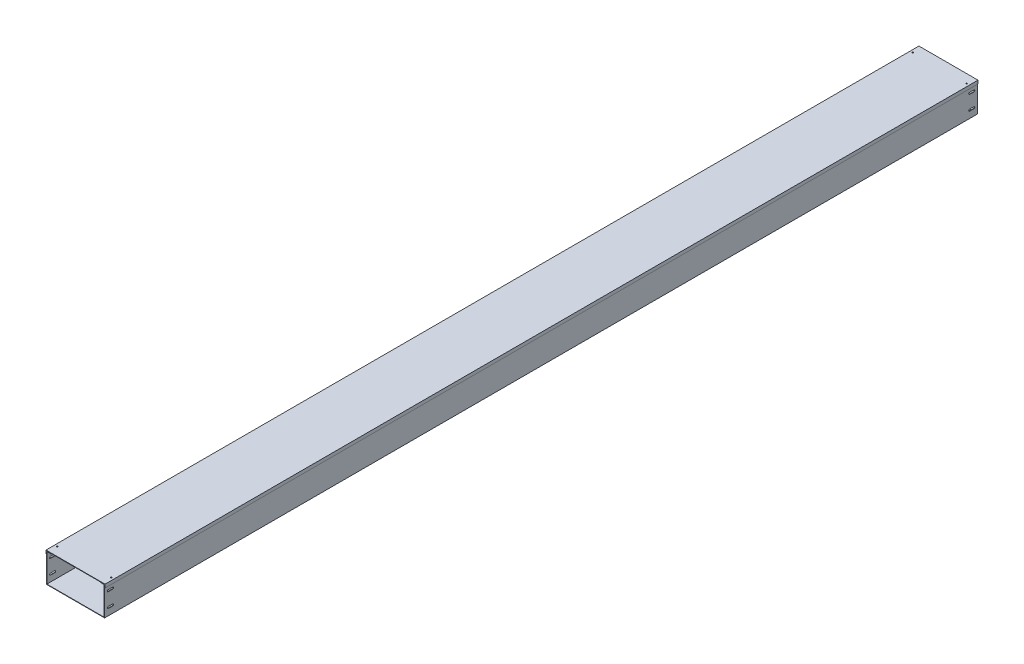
from build123d import *

# Parameters (mm, degrees)
EXTRUSION_DEPTH         = 3000
CUT_EXTRUDE1_DEPTH      = 3003.082610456
CUT_EXTRUDE1_DEPTH_BACK = 3003.082610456
CUT_EXTRUDE2_DEPTH      = 3003.082610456
CUT_EXTRUDE2_DEPTH_BACK = 3003.082610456
CUT_EXTRUDE3_REACH      = 3005.331
SKETCH3_R               = 2
CUT_EXTRUDE4_REACH      = 3005.331
SKETCH4_R               = 2
EXTRUDE_THIN1_DEPTH     = 3000
SKETCH6_R               = 2
CUT_EXTRUDE5_DEPTH      = 1.5
SKETCH7_R               = 2
CUT_EXTRUDE6_DEPTH      = 1.5


with BuildPart() as part:
    # DuctSketch → Extrusion (new body)
    with BuildSketch(Plane.XY):
        Polygon((-85, 50), (-100, 50), (-100, -50), (100, -50), (100, 50), (85, 50), (85, 48.5), (98.5, 48.5), (98.5, -48.5), (-98.5, -48.5), (-98.5, 48.5), (-85, 48.5), align=None)
    extrude(amount=EXTRUSION_DEPTH)

    # Sketch1 → Cut-Extrude1 (cut, two sides: drawn at the far end of the back side and taken through both)
    with BuildSketch(Plane(origin=(0, 0, 0), x_dir=(0, 0, -1), z_dir=(1, 0, 0)).offset(-CUT_EXTRUDE1_DEPTH_BACK)):
        with BuildLine():
            Line((-27.5, 28), (-12.5, 28))
            ThreePointArc((-12.5, 28), (-9.5, 25), (-12.5, 22))
            Line((-12.5, 22), (-27.5, 22))
            ThreePointArc((-27.5, 22), (-30.5, 25), (-27.5, 28))
        make_face()
        with BuildLine():
            Line((-27.5, -22), (-12.5, -22))
            ThreePointArc((-12.5, -22), (-9.5, -25), (-12.5, -28))
            Line((-12.5, -28), (-27.5, -28))
            ThreePointArc((-27.5, -28), (-30.5, -25), (-27.5, -22))
        make_face()
    extrude(amount=CUT_EXTRUDE1_DEPTH + CUT_EXTRUDE1_DEPTH_BACK, mode=Mode.SUBTRACT)

    # Sketch2 → Cut-Extrude2 (cut, two sides: drawn at the far end of the back side and taken through both)
    with BuildSketch(Plane(origin=(0, 0, 0), x_dir=(0, 0, -1), z_dir=(1, 0, 0)).offset(-CUT_EXTRUDE2_DEPTH_BACK)):
        with BuildLine():
            Line((-2987.5, 28), (-2972.5, 28))
            ThreePointArc((-2972.5, 28), (-2969.5, 25), (-2972.5, 22))
            Line((-2972.5, 22), (-2987.5, 22))
            ThreePointArc((-2987.5, 22), (-2990.5, 25), (-2987.5, 28))
        make_face()
        with BuildLine():
            Line((-2987.5, -22), (-2972.5, -22))
            ThreePointArc((-2972.5, -22), (-2969.5, -25), (-2972.5, -28))
            Line((-2972.5, -28), (-2987.5, -28))
            ThreePointArc((-2987.5, -28), (-2990.5, -25), (-2987.5, -22))
        make_face()
    extrude(amount=CUT_EXTRUDE2_DEPTH + CUT_EXTRUDE2_DEPTH_BACK, mode=Mode.SUBTRACT)

    # Sketch3 → Cut-Extrude3 (cut, up to next)
    with BuildSketch(Plane(origin=(0, 50, 0), x_dir=(1, 0, 0), z_dir=(0, 1, 0)), mode=Mode.PRIVATE) as cut_extrude3_sk1:
        with Locations(Location((-92.5, -30, 0), (0, 0, 270))):
            Circle(SKETCH3_R)
    cut_extrude3_tool1 = extrude(cut_extrude3_sk1.sketch, amount=-CUT_EXTRUDE3_REACH, mode=Mode.PRIVATE) & part.part
    # Sketch3 → Cut-Extrude3 (cut, up to next)
    with BuildSketch(Plane(origin=(0, 50, 0), x_dir=(1, 0, 0), z_dir=(0, 1, 0)), mode=Mode.PRIVATE) as cut_extrude3_sk2:
        with Locations(Location((92.5, -30, 0), (0, 0, 270))):
            Circle(SKETCH3_R)
    cut_extrude3_tool2 = extrude(cut_extrude3_sk2.sketch, amount=-CUT_EXTRUDE3_REACH, mode=Mode.PRIVATE) & part.part
    add(cut_extrude3_tool1.solids().sort_by_distance((-92.5, 50, 30))[0], mode=Mode.SUBTRACT)
    add(cut_extrude3_tool2.solids().sort_by_distance((92.5, 50, 30))[0], mode=Mode.SUBTRACT)

    # Sketch4 → Cut-Extrude4 (cut, up to next)
    with BuildSketch(Plane(origin=(0, 50, 0), x_dir=(1, 0, 0), z_dir=(0, 1, 0)), mode=Mode.PRIVATE) as cut_extrude4_sk1:
        with Locations(Location((-92.5, -2970, 0), (0, 0, 270))):
            Circle(SKETCH4_R)
    cut_extrude4_tool1 = extrude(cut_extrude4_sk1.sketch, amount=-CUT_EXTRUDE4_REACH, mode=Mode.PRIVATE) & part.part
    # Sketch4 → Cut-Extrude4 (cut, up to next)
    with BuildSketch(Plane(origin=(0, 50, 0), x_dir=(1, 0, 0), z_dir=(0, 1, 0)), mode=Mode.PRIVATE) as cut_extrude4_sk2:
        with Locations(Location((92.5, -2970, 0), (0, 0, 270))):
            Circle(SKETCH4_R)
    cut_extrude4_tool2 = extrude(cut_extrude4_sk2.sketch, amount=-CUT_EXTRUDE4_REACH, mode=Mode.PRIVATE) & part.part
    add(cut_extrude4_tool1.solids().sort_by_distance((-92.5, 50, 2970))[0], mode=Mode.SUBTRACT)
    add(cut_extrude4_tool2.solids().sort_by_distance((92.5, 50, 2970))[0], mode=Mode.SUBTRACT)


with BuildPart() as body_2:
    # Sketch5 → Extrude-Thin1 (new body)
    with BuildSketch(Plane.XY):
        Polygon((-100, 40), (-100, 50), (100, 50), (100, 40), (101.5, 40), (101.5, 51.5), (-101.5, 51.5), (-101.5, 40), align=None)
    extrude(amount=EXTRUDE_THIN1_DEPTH)

    # Sketch6 → Cut-Extrude5 (cut)
    with BuildSketch(Plane.XZ.offset(-51.5)):
        with Locations(Location((92.5, 30, 0), (0, 0, 90))):
            Circle(SKETCH6_R)
        with Locations(Location((-92.5, 30, 0), (0, 0, 90))):
            Circle(SKETCH6_R)
    extrude(amount=CUT_EXTRUDE5_DEPTH, mode=Mode.SUBTRACT)

    # Sketch7 → Cut-Extrude6 (cut)
    with BuildSketch(Plane(origin=(0, 51.5, 0), x_dir=(1, 0, 0), z_dir=(0, 1, 0))):
        with Locations(Location((-92.5, -2970, 0), (0, 0, 270))):
            Circle(SKETCH7_R)
        with Locations(Location((92.5, -2970, 0), (0, 0, 270))):
            Circle(SKETCH7_R)
    extrude(amount=-CUT_EXTRUDE6_DEPTH, mode=Mode.SUBTRACT)


solid = Compound([part.part, body_2.part])
